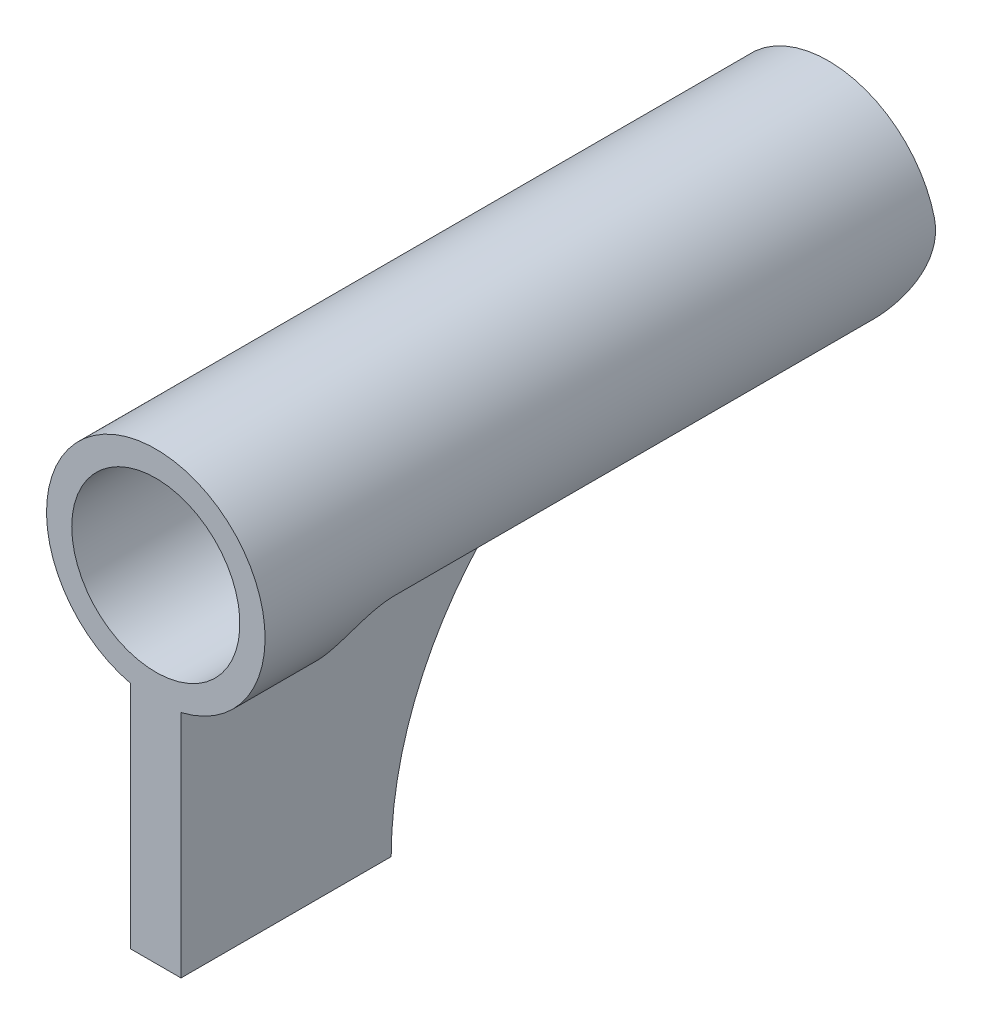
ISO-10303-21;
HEADER;
FILE_DESCRIPTION(('STEP AP214'),'2;1');
FILE_NAME('part.step','',(''),(''),'','','');
FILE_SCHEMA(('AUTOMOTIVE_DESIGN { 1 0 10303 214 1 1 1 1 }'));
ENDSEC;
DATA;
#1=APPLICATION_CONTEXT('core data for automotive mechanical design processes');
#2=APPLICATION_PROTOCOL_DEFINITION('international standard','automotive_design',2000,#1);
#3=PRODUCT_CONTEXT('',#1,'mechanical');
#4=PRODUCT('Part','Part','',(#3));
#5=PRODUCT_RELATED_PRODUCT_CATEGORY('part','',(#4));
#6=PRODUCT_DEFINITION_FORMATION('','',#4);
#7=PRODUCT_DEFINITION_CONTEXT('part definition',#1,'design');
#8=PRODUCT_DEFINITION('design','',#6,#7);
#9=PRODUCT_DEFINITION_SHAPE('','',#8);
#10=(LENGTH_UNIT() NAMED_UNIT(*) SI_UNIT(.MILLI.,.METRE.));
#11=(NAMED_UNIT(*) PLANE_ANGLE_UNIT() SI_UNIT($,.RADIAN.));
#12=(NAMED_UNIT(*) SI_UNIT($,.STERADIAN.) SOLID_ANGLE_UNIT());
#13=UNCERTAINTY_MEASURE_WITH_UNIT(LENGTH_MEASURE(1.E-05),#10,'distance_accuracy_value','');
#14=(GEOMETRIC_REPRESENTATION_CONTEXT(3) GLOBAL_UNCERTAINTY_ASSIGNED_CONTEXT((#13)) GLOBAL_UNIT_ASSIGNED_CONTEXT((#10,
#11,#12)) REPRESENTATION_CONTEXT('',''));
#15=CARTESIAN_POINT('',(0.,0.,0.));
#16=DIRECTION('',(0.,0.,1.));
#17=DIRECTION('',(1.,0.,0.));
#18=AXIS2_PLACEMENT_3D('',#15,#16,#17);
#19=CARTESIAN_POINT('',(0.,0.,8.));
#20=DIRECTION('',(0.,0.,-1.));
#21=DIRECTION('',(-1.,0.,0.));
#22=AXIS2_PLACEMENT_3D('',#19,#20,#21);
#23=CYLINDRICAL_SURFACE('',#22,1.3);
#24=CARTESIAN_POINT('',(0.,0.,8.));
#25=DIRECTION('',(0.,0.,1.));
#26=DIRECTION('',(1.,0.,0.));
#27=AXIS2_PLACEMENT_3D('',#24,#25,#26);
#28=CIRCLE('',#27,1.3);
#29=CARTESIAN_POINT('',(0.3,-1.26491106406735,8.));
#30=VERTEX_POINT('',#29);
#31=CARTESIAN_POINT('',(-0.3,-1.26491106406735,8.));
#32=VERTEX_POINT('',#31);
#33=EDGE_CURVE('E130',#30,#32,#28,.T.);
#34=ORIENTED_EDGE('',*,*,#33,.F.);
#35=DIRECTION('',(0.,0.,-1.));
#36=VECTOR('',#35,1.);
#37=CARTESIAN_POINT('',(0.3,-1.26491106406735,8.));
#38=LINE('',#37,#36);
#39=CARTESIAN_POINT('',(0.3,-1.26491106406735,4.41878202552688));
#40=VERTEX_POINT('',#39);
#41=EDGE_CURVE('E131',#30,#40,#38,.T.);
#42=ORIENTED_EDGE('',*,*,#41,.T.);
#43=CARTESIAN_POINT('',(-0.3,-1.26491106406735,4.41878202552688));
#44=CARTESIAN_POINT('',(-0.273706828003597,-1.27114912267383,4.42462561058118));
#45=CARTESIAN_POINT('',(-0.247067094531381,-1.27659838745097,4.4296964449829));
#46=CARTESIAN_POINT('',(-0.193248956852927,-1.28584610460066,4.43826658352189));
#47=CARTESIAN_POINT('',(-0.166070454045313,-1.289644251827,4.44176559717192));
#48=CARTESIAN_POINT('',(-0.0854518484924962,-1.29829053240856,4.44971720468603));
#49=CARTESIAN_POINT('',(-0.0314900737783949,-1.30073309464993,4.45194071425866));
#50=CARTESIAN_POINT('',(0.0689139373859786,-1.2990076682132,4.45036380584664));
#51=CARTESIAN_POINT('',(0.115390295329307,-1.29568552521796,4.44733421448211));
#52=CARTESIAN_POINT('',(0.208286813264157,-1.28408877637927,4.43663993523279));
#53=CARTESIAN_POINT('',(0.254680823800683,-1.27570143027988,4.42886968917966));
#54=CARTESIAN_POINT('',(0.3,-1.26491106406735,4.41878202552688));
#55=B_SPLINE_CURVE_WITH_KNOTS('',3,(#43,#44,#45,#46,#47,#48,#49,#50,#51,#52,#53,#54),
.UNSPECIFIED.,.F.,.F.,(4,2,2,2,2,4),(0.,0.0828938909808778,0.16580309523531,0.327142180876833,
0.466756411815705,0.609598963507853),.UNSPECIFIED.);
#56=CARTESIAN_POINT('',(-0.3,-1.26491106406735,4.41878202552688));
#57=VERTEX_POINT('',#56);
#58=EDGE_CURVE('E134',#57,#40,#55,.T.);
#59=ORIENTED_EDGE('',*,*,#58,.F.);
#60=DIRECTION('',(0.,0.,-1.));
#61=VECTOR('',#60,1.);
#62=CARTESIAN_POINT('',(-0.3,-1.26491106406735,8.));
#63=LINE('',#62,#61);
#64=EDGE_CURVE('E136',#32,#57,#63,.T.);
#65=ORIENTED_EDGE('',*,*,#64,.F.);
#66=EDGE_LOOP('',(#34,#42,#59,#65));
#67=FACE_BOUND('',#66,.T.);
#68=CARTESIAN_POINT('',(1.26279432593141,0.308788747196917,0.));
#69=CARTESIAN_POINT('',(1.26702625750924,0.291488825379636,-6.55650727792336E-07));
#70=CARTESIAN_POINT('',(1.2708976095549,0.274107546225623,0.000641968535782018));
#71=CARTESIAN_POINT('',(1.27790945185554,0.239295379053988,0.00323924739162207));
#72=CARTESIAN_POINT('',(1.28104991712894,0.221864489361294,0.00519394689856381));
#73=CARTESIAN_POINT('',(1.2893393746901,0.169798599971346,0.0130447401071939));
#74=CARTESIAN_POINT('',(1.29338811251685,0.135259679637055,0.0209271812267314));
#75=CARTESIAN_POINT('',(1.2986880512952,0.067573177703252,0.0419165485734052));
#76=CARTESIAN_POINT('',(1.29993671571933,0.0344268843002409,0.0550281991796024));
#77=CARTESIAN_POINT('',(1.30005860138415,-0.0294921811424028,0.086135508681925));
#78=CARTESIAN_POINT('',(1.29893134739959,-0.060264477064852,0.104132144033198));
#79=CARTESIAN_POINT('',(1.29487662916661,-0.119068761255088,0.144810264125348));
#80=CARTESIAN_POINT('',(1.29192284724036,-0.147053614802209,0.167556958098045));
#81=CARTESIAN_POINT('',(1.28492522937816,-0.199145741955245,0.216995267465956));
#82=CARTESIAN_POINT('',(1.28088074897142,-0.22325070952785,0.243689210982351));
#83=CARTESIAN_POINT('',(1.27214011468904,-0.268773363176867,0.302617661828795));
#84=CARTESIAN_POINT('',(1.26741775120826,-0.289838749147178,0.335121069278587));
#85=CARTESIAN_POINT('',(1.25851024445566,-0.326349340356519,0.403197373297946));
#86=CARTESIAN_POINT('',(1.25432487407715,-0.341796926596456,0.4387689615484));
#87=CARTESIAN_POINT('',(1.24736986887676,-0.366386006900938,0.51138656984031));
#88=CARTESIAN_POINT('',(1.24457412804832,-0.375645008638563,0.548390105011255));
#89=CARTESIAN_POINT('',(1.24072673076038,-0.388082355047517,0.623581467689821));
#90=CARTESIAN_POINT('',(1.23967937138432,-0.391245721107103,0.661771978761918));
#91=CARTESIAN_POINT('',(1.23973939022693,-0.391211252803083,0.7));
#92=B_SPLINE_CURVE_WITH_KNOTS('',3,(#68,#69,#70,#71,#72,#73,#74,#75,#76,#77,#78,#79,#80,#81,#82,
#83,#84,#85,#86,#87,#88,#89,#90,#91),.UNSPECIFIED.,.F.,.F.,(4,2,2,2,2,2,2,2,2,2,2,4),(0.,
0.0534003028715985,0.106802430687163,0.213208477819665,0.319710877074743,0.426234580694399,
0.534330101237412,0.642489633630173,0.759018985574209,0.875498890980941,0.9896990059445,
1.1041793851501),.UNSPECIFIED.);
#93=CARTESIAN_POINT('',(1.26279432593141,0.308788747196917,0.));
#94=VERTEX_POINT('',#93);
#95=CARTESIAN_POINT('',(1.23973939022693,-0.391211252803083,0.7));
#96=VERTEX_POINT('',#95);
#97=EDGE_CURVE('E48',#94,#96,#92,.T.);
#98=ORIENTED_EDGE('',*,*,#97,.F.);
#99=CARTESIAN_POINT('',(0.,0.,0.));
#100=DIRECTION('',(0.,0.,1.));
#101=DIRECTION('',(1.,0.,0.));
#102=AXIS2_PLACEMENT_3D('',#99,#100,#101);
#103=CIRCLE('',#102,1.3);
#104=CARTESIAN_POINT('',(0.391211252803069,-1.23973939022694,0.));
#105=VERTEX_POINT('',#104);
#106=EDGE_CURVE('E120',#94,#105,#103,.T.);
#107=ORIENTED_EDGE('',*,*,#106,.T.);
#108=DIRECTION('',(0.,0.,-1.));
#109=VECTOR('',#108,1.);
#110=CARTESIAN_POINT('',(0.391211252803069,-1.23973939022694,7.));
#111=LINE('',#110,#109);
#112=CARTESIAN_POINT('',(0.391211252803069,-1.23973939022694,6.4));
#113=VERTEX_POINT('',#112);
#114=EDGE_CURVE('E260',#113,#105,#111,.T.);
#115=ORIENTED_EDGE('',*,*,#114,.F.);
#116=CARTESIAN_POINT('',(0.391211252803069,-1.23973939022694,6.4));
#117=CARTESIAN_POINT('',(0.391145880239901,-1.23972503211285,6.43180258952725));
#118=CARTESIAN_POINT('',(0.393926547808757,-1.23888310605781,6.46355113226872));
#119=CARTESIAN_POINT('',(0.404631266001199,-1.23544613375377,6.5259092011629));
#120=CARTESIAN_POINT('',(0.412528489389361,-1.23286022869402,6.55652379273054));
#121=CARTESIAN_POINT('',(0.432911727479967,-1.22584489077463,6.61588480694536));
#122=CARTESIAN_POINT('',(0.445390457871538,-1.22141838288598,6.64463411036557));
#123=CARTESIAN_POINT('',(0.474185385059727,-1.21053150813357,6.69975763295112));
#124=CARTESIAN_POINT('',(0.490506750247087,-1.2040683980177,6.7261285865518));
#125=CARTESIAN_POINT('',(0.527446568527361,-1.18837233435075,6.77771565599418));
#126=CARTESIAN_POINT('',(0.548283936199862,-1.17897892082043,6.80272625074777));
#127=CARTESIAN_POINT('',(0.592545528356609,-1.15736611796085,6.84896104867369));
#128=CARTESIAN_POINT('',(0.61597045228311,-1.14514596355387,6.87018422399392));
#129=CARTESIAN_POINT('',(0.665864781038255,-1.11691078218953,6.90940049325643));
#130=CARTESIAN_POINT('',(0.692431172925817,-1.10072181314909,6.92714672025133));
#131=CARTESIAN_POINT('',(0.74630573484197,-1.06492731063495,6.9571960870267));
#132=CARTESIAN_POINT('',(0.773612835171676,-1.04532650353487,6.96950667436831));
#133=CARTESIAN_POINT('',(0.820997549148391,-1.00827838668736,6.98580318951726));
#134=CARTESIAN_POINT('',(0.841171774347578,-0.991522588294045,6.99110223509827));
#135=CARTESIAN_POINT('',(0.880841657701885,-0.956468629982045,6.99821144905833));
#136=CARTESIAN_POINT('',(0.900336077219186,-0.938167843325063,7.00001554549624));
#137=CARTESIAN_POINT('',(0.919238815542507,-0.919238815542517,7.));
#138=B_SPLINE_CURVE_WITH_KNOTS('',3,(#116,#117,#118,#119,#120,#121,#122,#123,#124,#125,#126,
#127,#128,#129,#130,#131,#132,#133,#134,#135,#136,#137),.UNSPECIFIED.,.F.,.F.,(4,2,2,2,2,2,2,2,
2,2,4),(0.,0.0951902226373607,0.189885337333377,0.284430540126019,0.379103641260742,
0.480314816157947,0.581553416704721,0.68845102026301,0.79520170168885,0.875197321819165,
0.955331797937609),.UNSPECIFIED.);
#139=CARTESIAN_POINT('',(0.919238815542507,-0.919238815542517,7.));
#140=VERTEX_POINT('',#139);
#141=EDGE_CURVE('E42',#113,#140,#138,.T.);
#142=ORIENTED_EDGE('',*,*,#141,.T.);
#143=CARTESIAN_POINT('',(0.919238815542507,-0.919238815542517,7.));
#144=CARTESIAN_POINT('',(0.941880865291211,-0.896653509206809,7.00003588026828));
#145=CARTESIAN_POINT('',(0.963605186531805,-0.873205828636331,6.99744589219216));
#146=CARTESIAN_POINT('',(1.00472185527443,-0.82552573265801,6.98731537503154));
#147=CARTESIAN_POINT('',(1.02412376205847,-0.801297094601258,6.97979602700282));
#148=CARTESIAN_POINT('',(1.06028234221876,-0.752810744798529,6.96011268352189));
#149=CARTESIAN_POINT('',(1.07704148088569,-0.728553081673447,6.94795305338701));
#150=CARTESIAN_POINT('',(1.10784865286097,-0.680792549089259,6.91941069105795));
#151=CARTESIAN_POINT('',(1.12189416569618,-0.657290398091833,6.90302406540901));
#152=CARTESIAN_POINT('',(1.14799243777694,-0.610627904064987,6.86549673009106));
#153=CARTESIAN_POINT('',(1.15989932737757,-0.587552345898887,6.84414939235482));
#154=CARTESIAN_POINT('',(1.18095559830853,-0.543994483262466,6.79774547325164));
#155=CARTESIAN_POINT('',(1.19010321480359,-0.523513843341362,6.77268653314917));
#156=CARTESIAN_POINT('',(1.20639418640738,-0.484852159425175,6.71763943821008));
#157=CARTESIAN_POINT('',(1.21337156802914,-0.466902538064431,6.6874383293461));
#158=CARTESIAN_POINT('',(1.22477407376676,-0.436117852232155,6.62412324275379));
#159=CARTESIAN_POINT('',(1.22920380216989,-0.423273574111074,6.59101464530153));
#160=CARTESIAN_POINT('',(1.23492981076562,-0.406214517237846,6.5315516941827));
#161=CARTESIAN_POINT('',(1.23673759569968,-0.400633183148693,6.50563393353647));
#162=CARTESIAN_POINT('',(1.23913995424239,-0.393111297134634,6.45315586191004));
#163=CARTESIAN_POINT('',(1.23973140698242,-0.391180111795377,6.42659407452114));
#164=CARTESIAN_POINT('',(1.23973939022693,-0.391211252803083,6.4));
#165=B_SPLINE_CURVE_WITH_KNOTS('',3,(#143,#144,#145,#146,#147,#148,#149,#150,#151,#152,#153,
#154,#155,#156,#157,#158,#159,#160,#161,#162,#163,#164),.UNSPECIFIED.,.F.,.F.,(4,2,2,2,2,2,2,2,
2,2,4),(0.,0.0957523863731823,0.191096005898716,0.286350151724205,0.381692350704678,
0.482109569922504,0.582590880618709,0.689510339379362,0.796235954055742,0.875683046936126,
0.955333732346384),.UNSPECIFIED.);
#166=CARTESIAN_POINT('',(1.23973939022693,-0.391211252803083,6.4));
#167=VERTEX_POINT('',#166);
#168=EDGE_CURVE('E268',#140,#167,#165,.T.);
#169=ORIENTED_EDGE('',*,*,#168,.T.);
#170=DIRECTION('',(0.,0.,-1.));
#171=VECTOR('',#170,1.);
#172=CARTESIAN_POINT('',(1.23973939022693,-0.391211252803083,7.));
#173=LINE('',#172,#171);
#174=EDGE_CURVE('E123',#167,#96,#173,.T.);
#175=ORIENTED_EDGE('',*,*,#174,.T.);
#176=EDGE_LOOP('',(#98,#107,#115,#142,#169,#175));
#177=FACE_BOUND('',#176,.T.);
#178=ADVANCED_FACE('F33',(#67,#177),#23,.T.);
#179=CARTESIAN_POINT('',(0.,0.,8.));
#180=DIRECTION('',(0.,0.,-1.));
#181=DIRECTION('',(-1.,0.,0.));
#182=AXIS2_PLACEMENT_3D('',#179,#180,#181);
#183=CYLINDRICAL_SURFACE('',#182,1.);
#184=CARTESIAN_POINT('',(0.,0.,8.));
#185=DIRECTION('',(0.,0.,-1.));
#186=DIRECTION('',(-1.,0.,0.));
#187=AXIS2_PLACEMENT_3D('',#184,#185,#186);
#188=CIRCLE('',#187,1.);
#189=CARTESIAN_POINT('',(-1.,0.,8.));
#190=VERTEX_POINT('',#189);
#191=EDGE_CURVE('E208',#190,#190,#188,.T.);
#192=ORIENTED_EDGE('',*,*,#191,.F.);
#193=EDGE_LOOP('',(#192));
#194=FACE_BOUND('',#193,.T.);
#195=CARTESIAN_POINT('',(0.920300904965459,-0.391211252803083,0.7));
#196=CARTESIAN_POINT('',(0.920296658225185,-0.391212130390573,0.680924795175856));
#197=CARTESIAN_POINT('',(0.920632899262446,-0.390431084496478,0.661859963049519));
#198=CARTESIAN_POINT('',(0.921946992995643,-0.387321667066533,0.623888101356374));
#199=CARTESIAN_POINT('',(0.922924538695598,-0.384994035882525,0.60498100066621));
#200=CARTESIAN_POINT('',(0.926747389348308,-0.375746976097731,0.548868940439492));
#201=CARTESIAN_POINT('',(0.930483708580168,-0.366562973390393,0.51207281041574));
#202=CARTESIAN_POINT('',(0.939602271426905,-0.342505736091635,0.440702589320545));
#203=CARTESIAN_POINT('',(0.944982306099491,-0.327640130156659,0.406125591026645));
#204=CARTESIAN_POINT('',(0.956408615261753,-0.292611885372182,0.339826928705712));
#205=CARTESIAN_POINT('',(0.962455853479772,-0.272441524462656,0.30810951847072));
#206=CARTESIAN_POINT('',(0.974422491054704,-0.22605990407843,0.24668538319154));
#207=CARTESIAN_POINT('',(0.980318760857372,-0.199588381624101,0.217169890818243));
#208=CARTESIAN_POINT('',(0.990317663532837,-0.141867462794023,0.16290116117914));
#209=CARTESIAN_POINT('',(0.994421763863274,-0.110622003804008,0.138144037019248));
#210=CARTESIAN_POINT('',(0.999503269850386,-0.0451470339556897,0.094835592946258));
#211=CARTESIAN_POINT('',(1.000568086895,-0.0110306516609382,0.076124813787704));
#212=CARTESIAN_POINT('',(0.998838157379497,0.0597613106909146,0.0446514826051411));
#213=CARTESIAN_POINT('',(0.99604666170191,0.0964347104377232,0.03188393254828));
#214=CARTESIAN_POINT('',(0.987115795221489,0.162668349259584,0.0147624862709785));
#215=CARTESIAN_POINT('',(0.981838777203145,0.192036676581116,0.00918127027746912));
#216=CARTESIAN_POINT('',(0.968545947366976,0.250681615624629,0.00178154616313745));
#217=CARTESIAN_POINT('',(0.960525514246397,0.279957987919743,-3.05761824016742E-05));
#218=CARTESIAN_POINT('',(0.951130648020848,0.308788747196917,0.));
#219=B_SPLINE_CURVE_WITH_KNOTS('',3,(#195,#196,#197,#198,#199,#200,#201,#202,#203,#204,#205,
#206,#207,#208,#209,#210,#211,#212,#213,#214,#215,#216,#217,#218),.UNSPECIFIED.,.F.,.F.,(4,2,2,
2,2,2,2,2,2,2,2,4),(0.,0.0571867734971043,0.114346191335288,0.228072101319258,0.341645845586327,
0.455385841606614,0.575059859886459,0.6946357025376,0.810736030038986,0.926738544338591,
1.01745624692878,1.1083275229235),.UNSPECIFIED.);
#220=CARTESIAN_POINT('',(0.989949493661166,-0.141421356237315,0.163986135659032));
#221=VERTEX_POINT('',#220);
#222=CARTESIAN_POINT('',(0.951130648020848,0.308788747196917,0.));
#223=VERTEX_POINT('',#222);
#224=EDGE_CURVE('E111',#221,#223,#219,.T.);
#225=ORIENTED_EDGE('',*,*,#224,.F.);
#226=DIRECTION('',(0.,0.,-1.));
#227=VECTOR('',#226,1.);
#228=CARTESIAN_POINT('',(0.989949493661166,-0.141421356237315,7.));
#229=LINE('',#228,#227);
#230=CARTESIAN_POINT('',(0.989949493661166,-0.141421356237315,6.4));
#231=VERTEX_POINT('',#230);
#232=EDGE_CURVE('E247',#231,#221,#229,.T.);
#233=ORIENTED_EDGE('',*,*,#232,.F.);
#234=CARTESIAN_POINT('',(0.989949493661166,-0.141421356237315,6.4));
#235=CARTESIAN_POINT('',(0.989921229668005,-0.141337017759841,6.43038459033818));
#236=CARTESIAN_POINT('',(0.9895438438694,-0.144274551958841,6.46067355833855));
#237=CARTESIAN_POINT('',(0.987872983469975,-0.155429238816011,6.51999124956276));
#238=CARTESIAN_POINT('',(0.986587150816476,-0.163602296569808,6.54902835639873));
#239=CARTESIAN_POINT('',(0.982894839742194,-0.184450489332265,6.60520834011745));
#240=CARTESIAN_POINT('',(0.980492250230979,-0.1971099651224,6.63235741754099));
#241=CARTESIAN_POINT('',(0.974228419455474,-0.226053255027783,6.68452350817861));
#242=CARTESIAN_POINT('',(0.970363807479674,-0.242345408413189,6.70953542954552));
#243=CARTESIAN_POINT('',(0.960249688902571,-0.279896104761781,6.75998404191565));
#244=CARTESIAN_POINT('',(0.953767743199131,-0.301517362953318,6.78510418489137));
#245=CARTESIAN_POINT('',(0.938053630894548,-0.347336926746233,6.83191259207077));
#246=CARTESIAN_POINT('',(0.928820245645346,-0.37153637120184,6.8535993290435));
#247=CARTESIAN_POINT('',(0.905993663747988,-0.424369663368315,6.89526696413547));
#248=CARTESIAN_POINT('',(0.8920352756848,-0.453199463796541,6.91480515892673));
#249=CARTESIAN_POINT('',(0.859845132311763,-0.511639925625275,6.94834263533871));
#250=CARTESIAN_POINT('',(0.841622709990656,-0.541248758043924,6.96235383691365));
#251=CARTESIAN_POINT('',(0.804850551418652,-0.594170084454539,6.98196415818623));
#252=CARTESIAN_POINT('',(0.787046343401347,-0.617592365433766,6.98866636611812));
#253=CARTESIAN_POINT('',(0.748894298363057,-0.663378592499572,6.99771273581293));
#254=CARTESIAN_POINT('',(0.728533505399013,-0.68573628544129,7.00003365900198));
#255=CARTESIAN_POINT('',(0.707106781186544,-0.707106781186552,7.));
#256=B_SPLINE_CURVE_WITH_KNOTS('',3,(#234,#235,#236,#237,#238,#239,#240,#241,#242,#243,#244,
#245,#246,#247,#248,#249,#250,#251,#252,#253,#254,#255),.UNSPECIFIED.,.F.,.F.,(4,2,2,2,2,2,2,2,
2,2,4),(0.,0.0908589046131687,0.180962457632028,0.270754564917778,0.360754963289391,
0.461673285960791,0.562636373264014,0.674590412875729,0.786301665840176,0.87639823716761,
0.966971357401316),.UNSPECIFIED.);
#257=CARTESIAN_POINT('',(0.707106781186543,-0.707106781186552,7.));
#258=VERTEX_POINT('',#257);
#259=EDGE_CURVE('E56',#231,#258,#256,.T.);
#260=ORIENTED_EDGE('',*,*,#259,.T.);
#261=CARTESIAN_POINT('',(0.707106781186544,-0.707106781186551,7.));
#262=CARTESIAN_POINT('',(0.68530643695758,-0.728971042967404,7.00003940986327));
#263=CARTESIAN_POINT('',(0.662469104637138,-0.74972528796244,6.99761990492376));
#264=CARTESIAN_POINT('',(0.615703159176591,-0.788545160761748,6.98820244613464));
#265=CARTESIAN_POINT('',(0.591781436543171,-0.806625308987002,6.98123042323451));
#266=CARTESIAN_POINT('',(0.54360153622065,-0.839857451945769,6.96305472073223));
#267=CARTESIAN_POINT('',(0.519343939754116,-0.855013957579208,6.95185764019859));
#268=CARTESIAN_POINT('',(0.471227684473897,-0.882446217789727,6.92567600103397));
#269=CARTESIAN_POINT('',(0.447369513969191,-0.894718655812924,6.91068712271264));
#270=CARTESIAN_POINT('',(0.399022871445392,-0.917358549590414,6.87609119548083));
#271=CARTESIAN_POINT('',(0.374623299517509,-0.927511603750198,6.85622052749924));
#272=CARTESIAN_POINT('',(0.327936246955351,-0.945029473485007,6.81301569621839));
#273=CARTESIAN_POINT('',(0.305651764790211,-0.952390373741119,6.78967673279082));
#274=CARTESIAN_POINT('',(0.261513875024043,-0.965506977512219,6.73680583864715));
#275=CARTESIAN_POINT('',(0.240053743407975,-0.970952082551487,6.70686503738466));
#276=CARTESIAN_POINT('',(0.202419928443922,-0.979488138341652,6.6436060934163));
#277=CARTESIAN_POINT('',(0.186228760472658,-0.982586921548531,6.61029961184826));
#278=CARTESIAN_POINT('',(0.163212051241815,-0.986649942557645,6.54772579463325));
#279=CARTESIAN_POINT('',(0.155179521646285,-0.987911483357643,6.5189267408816));
#280=CARTESIAN_POINT('',(0.144223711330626,-0.989550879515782,6.46012362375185));
#281=CARTESIAN_POINT('',(0.14134180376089,-0.989921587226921,6.43011176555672));
#282=CARTESIAN_POINT('',(0.141421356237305,-0.989949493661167,6.4));
#283=B_SPLINE_CURVE_WITH_KNOTS('',3,(#261,#262,#263,#264,#265,#266,#267,#268,#269,#270,#271,
#272,#273,#274,#275,#276,#277,#278,#279,#280,#281,#282),.UNSPECIFIED.,.F.,.F.,(4,2,2,2,2,2,2,2,
2,2,4),(0.,0.0924154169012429,0.184308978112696,0.276059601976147,0.367915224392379,
0.466721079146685,0.56566497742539,0.676830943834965,0.787624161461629,0.876944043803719,
0.966978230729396),.UNSPECIFIED.);
#284=CARTESIAN_POINT('',(0.141421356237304,-0.989949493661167,6.4));
#285=VERTEX_POINT('',#284);
#286=EDGE_CURVE('E235',#258,#285,#283,.T.);
#287=ORIENTED_EDGE('',*,*,#286,.T.);
#288=DIRECTION('',(0.,0.,-1.));
#289=VECTOR('',#288,1.);
#290=CARTESIAN_POINT('',(0.141421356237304,-0.989949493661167,7.));
#291=LINE('',#290,#289);
#292=CARTESIAN_POINT('',(0.141421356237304,-0.989949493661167,0.));
#293=VERTEX_POINT('',#292);
#294=EDGE_CURVE('E258',#285,#293,#291,.T.);
#295=ORIENTED_EDGE('',*,*,#294,.T.);
#296=CARTESIAN_POINT('',(0.,0.,0.));
#297=DIRECTION('',(0.,0.,-1.));
#298=DIRECTION('',(-1.,0.,0.));
#299=AXIS2_PLACEMENT_3D('',#296,#297,#298);
#300=CIRCLE('',#299,1.);
#301=EDGE_CURVE('E201',#293,#223,#300,.T.);
#302=ORIENTED_EDGE('',*,*,#301,.T.);
#303=EDGE_LOOP('',(#225,#233,#260,#287,#295,#302));
#304=FACE_BOUND('',#303,.T.);
#305=ADVANCED_FACE('F172',(#194,#304),#183,.F.);
#306=CARTESIAN_POINT('',(1.23973939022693,-0.391211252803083,7.));
#307=DIRECTION('',(0.707106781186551,0.707106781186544,0.));
#308=DIRECTION('',(-0.707106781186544,0.707106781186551,0.));
#309=AXIS2_PLACEMENT_3D('',#306,#307,#308);
#310=PLANE('',#309);
#311=CARTESIAN_POINT('',(0.539739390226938,0.308788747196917,0.7));
#312=DIRECTION('',(0.707106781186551,0.707106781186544,0.));
#313=DIRECTION('',(-0.707106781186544,0.707106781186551,0.));
#314=AXIS2_PLACEMENT_3D('',#311,#312,#313);
#315=ELLIPSE('',#314,0.989949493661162,0.7);
#316=EDGE_CURVE('E11',#96,#221,#315,.T.);
#317=ORIENTED_EDGE('',*,*,#316,.F.);
#318=ORIENTED_EDGE('',*,*,#174,.F.);
#319=DIRECTION('',(0.707106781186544,-0.707106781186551,0.));
#320=VECTOR('',#319,1.);
#321=CARTESIAN_POINT('',(1.23973939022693,-0.391211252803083,6.4));
#322=LINE('',#321,#320);
#323=EDGE_CURVE('E146',#167,#231,#322,.F.);
#324=ORIENTED_EDGE('',*,*,#323,.T.);
#325=ORIENTED_EDGE('',*,*,#232,.T.);
#326=EDGE_LOOP('',(#317,#318,#324,#325));
#327=FACE_BOUND('',#326,.T.);
#328=ADVANCED_FACE('F166',(#327),#310,.F.);
#329=CARTESIAN_POINT('',(0.,0.,8.));
#330=DIRECTION('',(0.,0.,1.));
#331=DIRECTION('',(1.,0.,0.));
#332=AXIS2_PLACEMENT_3D('',#329,#330,#331);
#333=PLANE('',#332);
#334=ORIENTED_EDGE('',*,*,#191,.T.);
#335=EDGE_LOOP('',(#334));
#336=FACE_BOUND('',#335,.T.);
#337=ORIENTED_EDGE('',*,*,#33,.T.);
#338=DIRECTION('',(0.,-1.,0.));
#339=VECTOR('',#338,1.);
#340=CARTESIAN_POINT('',(-0.3,0.,8.));
#341=LINE('',#340,#339);
#342=CARTESIAN_POINT('',(-0.3,-4.,8.));
#343=VERTEX_POINT('',#342);
#344=EDGE_CURVE('E206',#32,#343,#341,.T.);
#345=ORIENTED_EDGE('',*,*,#344,.T.);
#346=DIRECTION('',(-1.,0.,0.));
#347=VECTOR('',#346,1.);
#348=CARTESIAN_POINT('',(0.3,-4.,8.));
#349=LINE('',#348,#347);
#350=CARTESIAN_POINT('',(0.3,-4.,8.));
#351=VERTEX_POINT('',#350);
#352=EDGE_CURVE('E191',#351,#343,#349,.T.);
#353=ORIENTED_EDGE('',*,*,#352,.F.);
#354=DIRECTION('',(0.,-1.,0.));
#355=VECTOR('',#354,1.);
#356=CARTESIAN_POINT('',(0.3,0.,8.));
#357=LINE('',#356,#355);
#358=EDGE_CURVE('E186',#30,#351,#357,.T.);
#359=ORIENTED_EDGE('',*,*,#358,.F.);
#360=EDGE_LOOP('',(#337,#345,#353,#359));
#361=FACE_BOUND('',#360,.T.);
#362=ADVANCED_FACE('F164',(#336,#361),#333,.T.);
#363=CARTESIAN_POINT('',(0.,0.,0.));
#364=DIRECTION('',(0.,0.,1.));
#365=DIRECTION('',(1.,0.,0.));
#366=AXIS2_PLACEMENT_3D('',#363,#364,#365);
#367=PLANE('',#366);
#368=ORIENTED_EDGE('',*,*,#106,.F.);
#369=DIRECTION('',(-1.,0.,0.));
#370=VECTOR('',#369,1.);
#371=CARTESIAN_POINT('',(1.6,0.308788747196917,0.));
#372=LINE('',#371,#370);
#373=EDGE_CURVE('E108',#94,#223,#372,.T.);
#374=ORIENTED_EDGE('',*,*,#373,.T.);
#375=ORIENTED_EDGE('',*,*,#301,.F.);
#376=DIRECTION('',(-0.707106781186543,0.707106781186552,0.));
#377=VECTOR('',#376,1.);
#378=CARTESIAN_POINT('',(0.141421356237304,-0.989949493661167,0.));
#379=LINE('',#378,#377);
#380=EDGE_CURVE('E129',#105,#293,#379,.T.);
#381=ORIENTED_EDGE('',*,*,#380,.F.);
#382=EDGE_LOOP('',(#368,#374,#375,#381));
#383=FACE_BOUND('',#382,.T.);
#384=ADVANCED_FACE('F127',(#383),#367,.F.);
#385=CARTESIAN_POINT('',(0.3,-4.,1.5));
#386=DIRECTION('',(-1.,0.,0.));
#387=DIRECTION('',(0.,0.,1.));
#388=AXIS2_PLACEMENT_3D('',#385,#386,#387);
#389=CYLINDRICAL_SURFACE('',#388,4.);
#390=CARTESIAN_POINT('',(-0.3,-4.,1.5));
#391=DIRECTION('',(-1.,0.,0.));
#392=DIRECTION('',(0.,0.,-1.));
#393=AXIS2_PLACEMENT_3D('',#390,#391,#392);
#394=CIRCLE('',#393,4.);
#395=CARTESIAN_POINT('',(-0.3,-4.,5.5));
#396=VERTEX_POINT('',#395);
#397=EDGE_CURVE('E194',#396,#57,#394,.T.);
#398=ORIENTED_EDGE('',*,*,#397,.T.);
#399=ORIENTED_EDGE('',*,*,#58,.T.);
#400=CARTESIAN_POINT('',(0.3,-4.,1.5));
#401=DIRECTION('',(-1.,0.,0.));
#402=DIRECTION('',(0.,0.,-1.));
#403=AXIS2_PLACEMENT_3D('',#400,#401,#402);
#404=CIRCLE('',#403,4.);
#405=CARTESIAN_POINT('',(0.3,-4.,5.5));
#406=VERTEX_POINT('',#405);
#407=EDGE_CURVE('E189',#406,#40,#404,.T.);
#408=ORIENTED_EDGE('',*,*,#407,.F.);
#409=DIRECTION('',(-1.,0.,0.));
#410=VECTOR('',#409,1.);
#411=CARTESIAN_POINT('',(0.3,-4.,5.5));
#412=LINE('',#411,#410);
#413=EDGE_CURVE('E205',#406,#396,#412,.T.);
#414=ORIENTED_EDGE('',*,*,#413,.T.);
#415=EDGE_LOOP('',(#398,#399,#408,#414));
#416=FACE_BOUND('',#415,.T.);
#417=ADVANCED_FACE('F150',(#416),#389,.F.);
#418=CARTESIAN_POINT('',(0.3,-4.,1.5));
#419=DIRECTION('',(1.,0.,0.));
#420=DIRECTION('',(0.,0.,-1.));
#421=AXIS2_PLACEMENT_3D('',#418,#419,#420);
#422=PLANE('',#421);
#423=ORIENTED_EDGE('',*,*,#41,.F.);
#424=ORIENTED_EDGE('',*,*,#358,.T.);
#425=DIRECTION('',(0.,0.,-1.));
#426=VECTOR('',#425,1.);
#427=CARTESIAN_POINT('',(0.3,-4.,8.));
#428=LINE('',#427,#426);
#429=EDGE_CURVE('E193',#351,#406,#428,.T.);
#430=ORIENTED_EDGE('',*,*,#429,.T.);
#431=ORIENTED_EDGE('',*,*,#407,.T.);
#432=EDGE_LOOP('',(#423,#424,#430,#431));
#433=FACE_BOUND('',#432,.T.);
#434=ADVANCED_FACE('F155',(#433),#422,.T.);
#435=CARTESIAN_POINT('',(-0.3,-4.,1.5));
#436=DIRECTION('',(1.,0.,0.));
#437=DIRECTION('',(0.,0.,-1.));
#438=AXIS2_PLACEMENT_3D('',#435,#436,#437);
#439=PLANE('',#438);
#440=ORIENTED_EDGE('',*,*,#344,.F.);
#441=ORIENTED_EDGE('',*,*,#64,.T.);
#442=ORIENTED_EDGE('',*,*,#397,.F.);
#443=DIRECTION('',(0.,0.,-1.));
#444=VECTOR('',#443,1.);
#445=CARTESIAN_POINT('',(-0.3,-4.,8.));
#446=LINE('',#445,#444);
#447=EDGE_CURVE('E198',#343,#396,#446,.T.);
#448=ORIENTED_EDGE('',*,*,#447,.F.);
#449=EDGE_LOOP('',(#440,#441,#442,#448));
#450=FACE_BOUND('',#449,.T.);
#451=ADVANCED_FACE('F157',(#450),#439,.F.);
#452=CARTESIAN_POINT('',(0.3,-4.,8.));
#453=DIRECTION('',(0.,1.,0.));
#454=DIRECTION('',(0.,0.,1.));
#455=AXIS2_PLACEMENT_3D('',#452,#453,#454);
#456=PLANE('',#455);
#457=ORIENTED_EDGE('',*,*,#447,.T.);
#458=ORIENTED_EDGE('',*,*,#413,.F.);
#459=ORIENTED_EDGE('',*,*,#429,.F.);
#460=ORIENTED_EDGE('',*,*,#352,.T.);
#461=EDGE_LOOP('',(#457,#458,#459,#460));
#462=FACE_BOUND('',#461,.T.);
#463=ADVANCED_FACE('F159',(#462),#456,.F.);
#464=CARTESIAN_POINT('',(0.141421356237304,-0.989949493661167,7.));
#465=DIRECTION('',(-0.707106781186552,-0.707106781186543,0.));
#466=DIRECTION('',(0.707106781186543,-0.707106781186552,0.));
#467=AXIS2_PLACEMENT_3D('',#464,#465,#466);
#468=PLANE('',#467);
#469=ORIENTED_EDGE('',*,*,#294,.F.);
#470=DIRECTION('',(-0.707106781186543,0.707106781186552,0.));
#471=VECTOR('',#470,1.);
#472=CARTESIAN_POINT('',(0.141421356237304,-0.989949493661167,6.4));
#473=LINE('',#472,#471);
#474=EDGE_CURVE('E265',#285,#113,#473,.F.);
#475=ORIENTED_EDGE('',*,*,#474,.T.);
#476=ORIENTED_EDGE('',*,*,#114,.T.);
#477=ORIENTED_EDGE('',*,*,#380,.T.);
#478=EDGE_LOOP('',(#469,#475,#476,#477));
#479=FACE_BOUND('',#478,.T.);
#480=ADVANCED_FACE('F162',(#479),#468,.F.);
#481=CARTESIAN_POINT('',(0.,0.,6.4));
#482=DIRECTION('',(-0.707106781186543,0.707106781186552,0.));
#483=DIRECTION('',(-0.707106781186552,-0.707106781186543,0.));
#484=AXIS2_PLACEMENT_3D('',#481,#482,#483);
#485=CYLINDRICAL_SURFACE('',#484,0.6);
#486=ORIENTED_EDGE('',*,*,#474,.F.);
#487=ORIENTED_EDGE('',*,*,#286,.F.);
#488=DIRECTION('',(-0.707106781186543,0.707106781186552,0.));
#489=VECTOR('',#488,1.);
#490=CARTESIAN_POINT('',(0.,0.,7.));
#491=LINE('',#490,#489);
#492=EDGE_CURVE('E124',#140,#258,#491,.T.);
#493=ORIENTED_EDGE('',*,*,#492,.F.);
#494=ORIENTED_EDGE('',*,*,#141,.F.);
#495=EDGE_LOOP('',(#486,#487,#493,#494));
#496=FACE_BOUND('',#495,.T.);
#497=ADVANCED_FACE('F35',(#496),#485,.F.);
#498=CARTESIAN_POINT('',(0.,0.,6.4));
#499=DIRECTION('',(0.707106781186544,-0.707106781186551,0.));
#500=DIRECTION('',(0.707106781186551,0.707106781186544,0.));
#501=AXIS2_PLACEMENT_3D('',#498,#499,#500);
#502=CYLINDRICAL_SURFACE('',#501,0.6);
#503=ORIENTED_EDGE('',*,*,#259,.F.);
#504=ORIENTED_EDGE('',*,*,#323,.F.);
#505=ORIENTED_EDGE('',*,*,#168,.F.);
#506=ORIENTED_EDGE('',*,*,#492,.T.);
#507=EDGE_LOOP('',(#503,#504,#505,#506));
#508=FACE_BOUND('',#507,.T.);
#509=ADVANCED_FACE('F273',(#508),#502,.F.);
#510=CARTESIAN_POINT('',(1.6,0.308788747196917,0.7));
#511=DIRECTION('',(-1.,0.,0.));
#512=DIRECTION('',(0.,0.,1.));
#513=AXIS2_PLACEMENT_3D('',#510,#511,#512);
#514=CYLINDRICAL_SURFACE('',#513,0.7);
#515=ORIENTED_EDGE('',*,*,#97,.T.);
#516=ORIENTED_EDGE('',*,*,#316,.T.);
#517=ORIENTED_EDGE('',*,*,#224,.T.);
#518=ORIENTED_EDGE('',*,*,#373,.F.);
#519=EDGE_LOOP('',(#515,#516,#517,#518));
#520=FACE_BOUND('',#519,.T.);
#521=ADVANCED_FACE('F109',(#520),#514,.T.);
#522=CLOSED_SHELL('',(#178,#305,#328,#362,#384,#417,#434,#451,#463,#480,#497,#509,#521));
#523=MANIFOLD_SOLID_BREP('B2',#522);
#524=ADVANCED_BREP_SHAPE_REPRESENTATION('',(#18,#523),#14);
#525=SHAPE_DEFINITION_REPRESENTATION(#9,#524);
ENDSEC;
END-ISO-10303-21;
